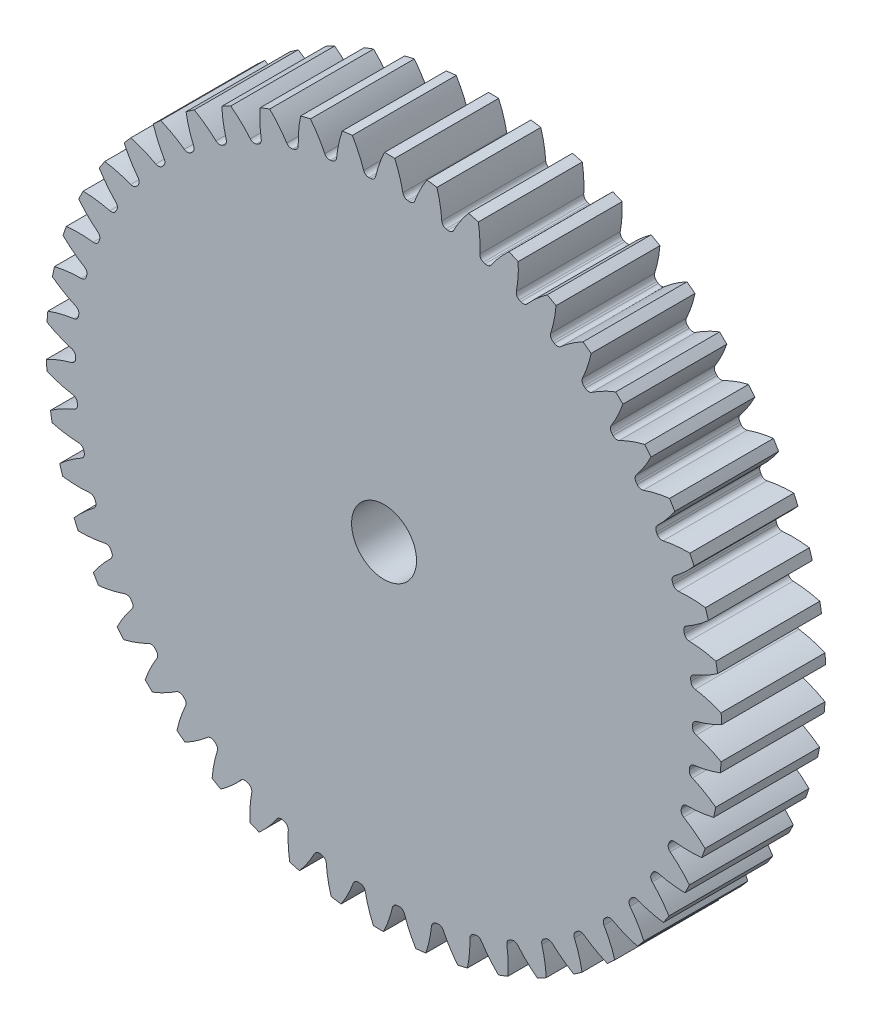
from build123d import *

# Parameters (mm, degrees)
SKETCH3_R         = 330.2
GEARBODY_DEPTH    = 101.6
TOOTHCUT_DEPTH    = 478.898148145
CIRPATTERN1_COUNT = 50
BOREDIA_R         = 31.75
BORE_DEPTH        = 12700


with BuildPart() as part:
    # Sketch3 → gearBody (new body)
    with BuildSketch(Plane.XY):
        Circle(SKETCH3_R)
    extrude(amount=GEARBODY_DEPTH)

    # Sketch2 → toothCut (cut, through all)
    with BuildSketch(Plane.XY):
        with BuildLine():
            ThreePointArc((301.567147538, -5.907296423), (301.583143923, -5.024731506), (301.596557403, -4.142123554))
            ThreePointArc((301.596557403, -4.142123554), (302.693417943, -1.028771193), (305.450757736, 0.785930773))
            ThreePointArc((305.450757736, 0.785930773), (318.098444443, 4.890593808), (330.2, 10.401001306))
            ThreePointArc((330.2, 10.401001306), (330.317926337, -5.503486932), (329.6702374, -21.395219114))
            ThreePointArc((329.6702374, -21.395219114), (317.758967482, -15.484729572), (305.255039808, -10.961010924))
            ThreePointArc((305.255039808, -10.961010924), (302.559683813, -9.055460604), (301.567147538, -5.907296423))
        make_face()
    toothcut = extrude(amount=TOOTHCUT_DEPTH, mode=Mode.SUBTRACT)

    # CirPattern1: toothCut ×50 about axis
    cirpattern1_axis = Axis((0, 0, 0), (0, 0, 1))
    for i in range(1, CIRPATTERN1_COUNT):
        add(toothcut.rotate(cirpattern1_axis, i * 360 / CIRPATTERN1_COUNT), mode=Mode.SUBTRACT)

    # boreDia → bore (cut, symmetric)
    with BuildSketch(Plane.XY):
        Circle(BOREDIA_R)
    extrude(amount=BORE_DEPTH, both=True, mode=Mode.SUBTRACT)


solid = part.part
